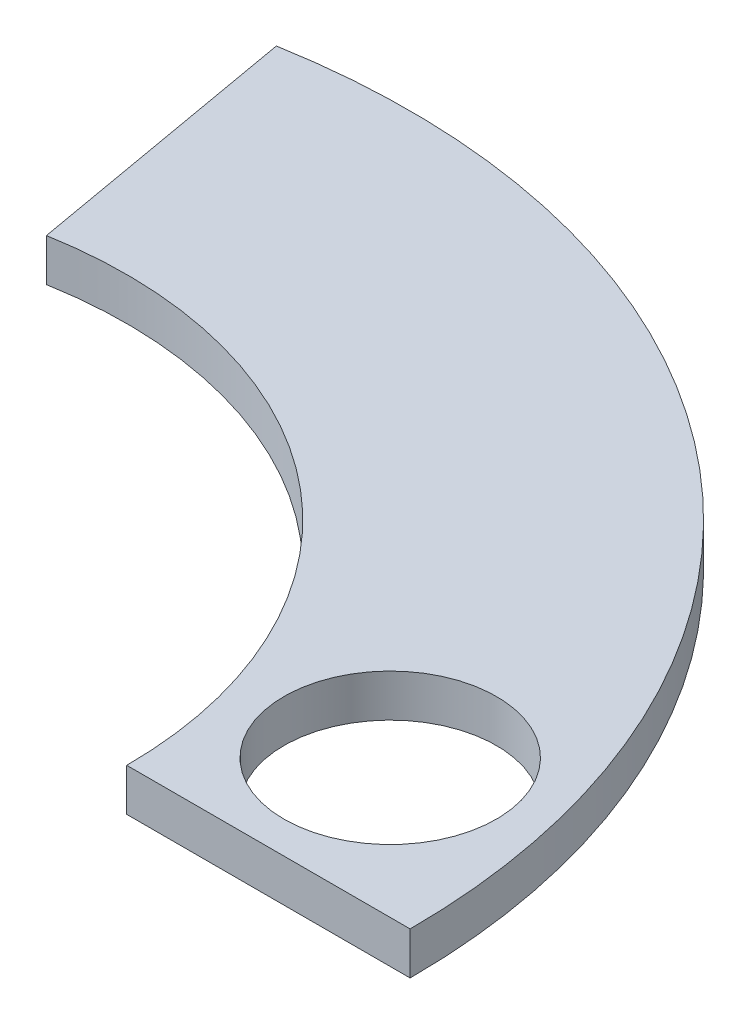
ISO-10303-21;
HEADER;
FILE_DESCRIPTION(('STEP AP214'),'2;1');
FILE_NAME('part.step','',(''),(''),'','','');
FILE_SCHEMA(('AUTOMOTIVE_DESIGN { 1 0 10303 214 1 1 1 1 }'));
ENDSEC;
DATA;
#1=APPLICATION_CONTEXT('core data for automotive mechanical design processes');
#2=APPLICATION_PROTOCOL_DEFINITION('international standard','automotive_design',2000,#1);
#3=PRODUCT_CONTEXT('',#1,'mechanical');
#4=PRODUCT('Part','Part','',(#3));
#5=PRODUCT_RELATED_PRODUCT_CATEGORY('part','',(#4));
#6=PRODUCT_DEFINITION_FORMATION('','',#4);
#7=PRODUCT_DEFINITION_CONTEXT('part definition',#1,'design');
#8=PRODUCT_DEFINITION('design','',#6,#7);
#9=PRODUCT_DEFINITION_SHAPE('','',#8);
#10=(LENGTH_UNIT() NAMED_UNIT(*) SI_UNIT(.MILLI.,.METRE.));
#11=(NAMED_UNIT(*) PLANE_ANGLE_UNIT() SI_UNIT($,.RADIAN.));
#12=(NAMED_UNIT(*) SI_UNIT($,.STERADIAN.) SOLID_ANGLE_UNIT());
#13=UNCERTAINTY_MEASURE_WITH_UNIT(LENGTH_MEASURE(1.E-05),#10,'distance_accuracy_value','');
#14=(GEOMETRIC_REPRESENTATION_CONTEXT(3) GLOBAL_UNCERTAINTY_ASSIGNED_CONTEXT((#13)) GLOBAL_UNIT_ASSIGNED_CONTEXT((#10,
#11,#12)) REPRESENTATION_CONTEXT('',''));
#15=CARTESIAN_POINT('',(0.,0.,0.));
#16=DIRECTION('',(0.,0.,1.));
#17=DIRECTION('',(1.,0.,0.));
#18=AXIS2_PLACEMENT_3D('',#15,#16,#17);
#19=CARTESIAN_POINT('',(0.,3.,0.));
#20=DIRECTION('',(0.,-1.,0.));
#21=DIRECTION('',(0.,0.,-1.));
#22=AXIS2_PLACEMENT_3D('',#19,#20,#21);
#23=CYLINDRICAL_SURFACE('',#22,30.);
#24=CARTESIAN_POINT('',(0.,0.,0.));
#25=DIRECTION('',(0.,1.,0.));
#26=DIRECTION('',(0.,0.,1.));
#27=AXIS2_PLACEMENT_3D('',#24,#25,#26);
#28=CIRCLE('',#27,30.);
#29=CARTESIAN_POINT('',(30.,0.,0.));
#30=VERTEX_POINT('',#29);
#31=CARTESIAN_POINT('',(-5.20944533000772,0.,-29.5442325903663));
#32=VERTEX_POINT('',#31);
#33=EDGE_CURVE('E107',#30,#32,#28,.T.);
#34=ORIENTED_EDGE('',*,*,#33,.F.);
#35=DIRECTION('',(0.,-1.,0.));
#36=VECTOR('',#35,1.);
#37=CARTESIAN_POINT('',(30.,3.,0.));
#38=LINE('',#37,#36);
#39=CARTESIAN_POINT('',(30.,3.,0.));
#40=VERTEX_POINT('',#39);
#41=EDGE_CURVE('E11',#40,#30,#38,.T.);
#42=ORIENTED_EDGE('',*,*,#41,.F.);
#43=CARTESIAN_POINT('',(0.,3.,0.));
#44=DIRECTION('',(0.,1.,0.));
#45=DIRECTION('',(0.,0.,1.));
#46=AXIS2_PLACEMENT_3D('',#43,#44,#45);
#47=CIRCLE('',#46,30.);
#48=CARTESIAN_POINT('',(-5.20944533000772,3.,-29.5442325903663));
#49=VERTEX_POINT('',#48);
#50=EDGE_CURVE('E91',#40,#49,#47,.T.);
#51=ORIENTED_EDGE('',*,*,#50,.T.);
#52=DIRECTION('',(0.,-1.,0.));
#53=VECTOR('',#52,1.);
#54=CARTESIAN_POINT('',(-5.20944533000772,3.,-29.5442325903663));
#55=LINE('',#54,#53);
#56=EDGE_CURVE('E53',#49,#32,#55,.T.);
#57=ORIENTED_EDGE('',*,*,#56,.T.);
#58=EDGE_LOOP('',(#34,#42,#51,#57));
#59=FACE_BOUND('',#58,.T.);
#60=ADVANCED_FACE('F36',(#59),#23,.F.);
#61=CARTESIAN_POINT('',(0.,3.,0.));
#62=DIRECTION('',(0.,0.,-1.));
#63=DIRECTION('',(-1.,0.,0.));
#64=AXIS2_PLACEMENT_3D('',#61,#62,#63);
#65=PLANE('',#64);
#66=DIRECTION('',(1.,0.,0.));
#67=VECTOR('',#66,1.);
#68=CARTESIAN_POINT('',(0.,0.,0.));
#69=LINE('',#68,#67);
#70=CARTESIAN_POINT('',(50.,0.,0.));
#71=VERTEX_POINT('',#70);
#72=EDGE_CURVE('E96',#30,#71,#69,.T.);
#73=ORIENTED_EDGE('',*,*,#72,.T.);
#74=DIRECTION('',(0.,-1.,0.));
#75=VECTOR('',#74,1.);
#76=CARTESIAN_POINT('',(50.,3.,0.));
#77=LINE('',#76,#75);
#78=CARTESIAN_POINT('',(50.,3.,0.));
#79=VERTEX_POINT('',#78);
#80=EDGE_CURVE('E45',#79,#71,#77,.T.);
#81=ORIENTED_EDGE('',*,*,#80,.F.);
#82=DIRECTION('',(1.,0.,0.));
#83=VECTOR('',#82,1.);
#84=CARTESIAN_POINT('',(0.,3.,0.));
#85=LINE('',#84,#83);
#86=EDGE_CURVE('E87',#40,#79,#85,.T.);
#87=ORIENTED_EDGE('',*,*,#86,.F.);
#88=ORIENTED_EDGE('',*,*,#41,.T.);
#89=EDGE_LOOP('',(#73,#81,#87,#88));
#90=FACE_BOUND('',#89,.T.);
#91=ADVANCED_FACE('F94',(#90),#65,.F.);
#92=CARTESIAN_POINT('',(0.,3.,0.));
#93=DIRECTION('',(0.,-1.,0.));
#94=DIRECTION('',(0.,0.,-1.));
#95=AXIS2_PLACEMENT_3D('',#92,#93,#94);
#96=CYLINDRICAL_SURFACE('',#95,50.);
#97=CARTESIAN_POINT('',(0.,0.,0.));
#98=DIRECTION('',(0.,1.,0.));
#99=DIRECTION('',(0.,0.,1.));
#100=AXIS2_PLACEMENT_3D('',#97,#98,#99);
#101=CIRCLE('',#100,50.);
#102=CARTESIAN_POINT('',(-8.68240888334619,0.,-49.2403876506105));
#103=VERTEX_POINT('',#102);
#104=EDGE_CURVE('E104',#71,#103,#101,.T.);
#105=ORIENTED_EDGE('',*,*,#104,.T.);
#106=DIRECTION('',(0.,-1.,0.));
#107=VECTOR('',#106,1.);
#108=CARTESIAN_POINT('',(-8.68240888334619,3.,-49.2403876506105));
#109=LINE('',#108,#107);
#110=CARTESIAN_POINT('',(-8.68240888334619,3.,-49.2403876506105));
#111=VERTEX_POINT('',#110);
#112=EDGE_CURVE('E67',#111,#103,#109,.T.);
#113=ORIENTED_EDGE('',*,*,#112,.F.);
#114=CARTESIAN_POINT('',(0.,3.,0.));
#115=DIRECTION('',(0.,1.,0.));
#116=DIRECTION('',(0.,0.,1.));
#117=AXIS2_PLACEMENT_3D('',#114,#115,#116);
#118=CIRCLE('',#117,50.);
#119=EDGE_CURVE('E79',#79,#111,#118,.T.);
#120=ORIENTED_EDGE('',*,*,#119,.F.);
#121=ORIENTED_EDGE('',*,*,#80,.T.);
#122=EDGE_LOOP('',(#105,#113,#120,#121));
#123=FACE_BOUND('',#122,.T.);
#124=ADVANCED_FACE('F81',(#123),#96,.T.);
#125=CARTESIAN_POINT('',(38.8388208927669,3.,-9.7557361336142));
#126=DIRECTION('',(0.,-1.,0.));
#127=DIRECTION('',(0.,0.,-1.));
#128=AXIS2_PLACEMENT_3D('',#125,#126,#127);
#129=CYLINDRICAL_SURFACE('',#128,7.5);
#130=CARTESIAN_POINT('',(38.8388208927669,3.,-9.7557361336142));
#131=DIRECTION('',(0.,1.,0.));
#132=DIRECTION('',(0.,0.,1.));
#133=AXIS2_PLACEMENT_3D('',#130,#131,#132);
#134=CIRCLE('',#133,7.5);
#135=CARTESIAN_POINT('',(38.8388208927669,3.,-2.2557361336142));
#136=VERTEX_POINT('',#135);
#137=EDGE_CURVE('E103',#136,#136,#134,.T.);
#138=ORIENTED_EDGE('',*,*,#137,.T.);
#139=EDGE_LOOP('',(#138));
#140=FACE_BOUND('',#139,.T.);
#141=CARTESIAN_POINT('',(38.8388208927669,0.,-9.7557361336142));
#142=DIRECTION('',(0.,1.,0.));
#143=DIRECTION('',(0.,0.,1.));
#144=AXIS2_PLACEMENT_3D('',#141,#142,#143);
#145=CIRCLE('',#144,7.5);
#146=CARTESIAN_POINT('',(38.8388208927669,0.,-2.2557361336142));
#147=VERTEX_POINT('',#146);
#148=EDGE_CURVE('E109',#147,#147,#145,.T.);
#149=ORIENTED_EDGE('',*,*,#148,.F.);
#150=EDGE_LOOP('',(#149));
#151=FACE_BOUND('',#150,.T.);
#152=ADVANCED_FACE('F38',(#140,#151),#129,.F.);
#153=CARTESIAN_POINT('',(0.,3.,0.));
#154=DIRECTION('',(-0.984807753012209,0.,0.173648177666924));
#155=DIRECTION('',(0.173648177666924,0.,0.984807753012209));
#156=AXIS2_PLACEMENT_3D('',#153,#154,#155);
#157=PLANE('',#156);
#158=DIRECTION('',(-0.173648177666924,0.,-0.984807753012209));
#159=VECTOR('',#158,1.);
#160=CARTESIAN_POINT('',(0.,0.,0.));
#161=LINE('',#160,#159);
#162=EDGE_CURVE('E100',#32,#103,#161,.T.);
#163=ORIENTED_EDGE('',*,*,#162,.F.);
#164=ORIENTED_EDGE('',*,*,#56,.F.);
#165=DIRECTION('',(-0.173648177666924,0.,-0.984807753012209));
#166=VECTOR('',#165,1.);
#167=CARTESIAN_POINT('',(0.,3.,0.));
#168=LINE('',#167,#166);
#169=EDGE_CURVE('E86',#49,#111,#168,.T.);
#170=ORIENTED_EDGE('',*,*,#169,.T.);
#171=ORIENTED_EDGE('',*,*,#112,.T.);
#172=EDGE_LOOP('',(#163,#164,#170,#171));
#173=FACE_BOUND('',#172,.T.);
#174=ADVANCED_FACE('F121',(#173),#157,.T.);
#175=CARTESIAN_POINT('',(0.,3.,0.));
#176=DIRECTION('',(0.,1.,0.));
#177=DIRECTION('',(0.,0.,1.));
#178=AXIS2_PLACEMENT_3D('',#175,#176,#177);
#179=PLANE('',#178);
#180=ORIENTED_EDGE('',*,*,#137,.F.);
#181=EDGE_LOOP('',(#180));
#182=FACE_BOUND('',#181,.T.);
#183=ORIENTED_EDGE('',*,*,#50,.F.);
#184=ORIENTED_EDGE('',*,*,#86,.T.);
#185=ORIENTED_EDGE('',*,*,#119,.T.);
#186=ORIENTED_EDGE('',*,*,#169,.F.);
#187=EDGE_LOOP('',(#183,#184,#185,#186));
#188=FACE_BOUND('',#187,.T.);
#189=ADVANCED_FACE('F90',(#182,#188),#179,.T.);
#190=CARTESIAN_POINT('',(0.,0.,0.));
#191=DIRECTION('',(0.,1.,0.));
#192=DIRECTION('',(0.,0.,1.));
#193=AXIS2_PLACEMENT_3D('',#190,#191,#192);
#194=PLANE('',#193);
#195=ORIENTED_EDGE('',*,*,#148,.T.);
#196=EDGE_LOOP('',(#195));
#197=FACE_BOUND('',#196,.T.);
#198=ORIENTED_EDGE('',*,*,#33,.T.);
#199=ORIENTED_EDGE('',*,*,#162,.T.);
#200=ORIENTED_EDGE('',*,*,#104,.F.);
#201=ORIENTED_EDGE('',*,*,#72,.F.);
#202=EDGE_LOOP('',(#198,#199,#200,#201));
#203=FACE_BOUND('',#202,.T.);
#204=ADVANCED_FACE('F120',(#197,#203),#194,.F.);
#205=CLOSED_SHELL('',(#60,#91,#124,#152,#174,#189,#204));
#206=MANIFOLD_SOLID_BREP('B2',#205);
#207=ADVANCED_BREP_SHAPE_REPRESENTATION('',(#18,#206),#14);
#208=SHAPE_DEFINITION_REPRESENTATION(#9,#207);
ENDSEC;
END-ISO-10303-21;
